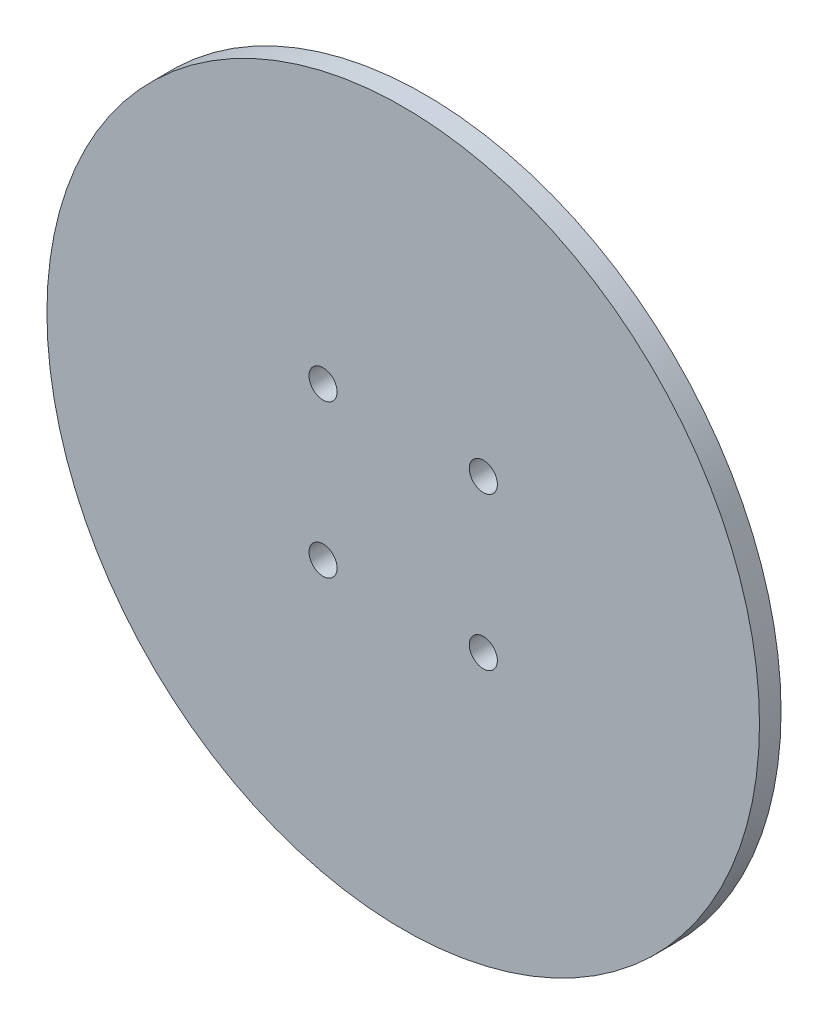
ISO-10303-21;
HEADER;
FILE_DESCRIPTION(('STEP AP214'),'2;1');
FILE_NAME('part.step','',(''),(''),'','','');
FILE_SCHEMA(('AUTOMOTIVE_DESIGN { 1 0 10303 214 1 1 1 1 }'));
ENDSEC;
DATA;
#1=APPLICATION_CONTEXT('core data for automotive mechanical design processes');
#2=APPLICATION_PROTOCOL_DEFINITION('international standard','automotive_design',2000,#1);
#3=PRODUCT_CONTEXT('',#1,'mechanical');
#4=PRODUCT('Part','Part','',(#3));
#5=PRODUCT_RELATED_PRODUCT_CATEGORY('part','',(#4));
#6=PRODUCT_DEFINITION_FORMATION('','',#4);
#7=PRODUCT_DEFINITION_CONTEXT('part definition',#1,'design');
#8=PRODUCT_DEFINITION('design','',#6,#7);
#9=PRODUCT_DEFINITION_SHAPE('','',#8);
#10=(LENGTH_UNIT() NAMED_UNIT(*) SI_UNIT(.MILLI.,.METRE.));
#11=(NAMED_UNIT(*) PLANE_ANGLE_UNIT() SI_UNIT($,.RADIAN.));
#12=(NAMED_UNIT(*) SI_UNIT($,.STERADIAN.) SOLID_ANGLE_UNIT());
#13=UNCERTAINTY_MEASURE_WITH_UNIT(LENGTH_MEASURE(1.E-05),#10,'distance_accuracy_value','');
#14=(GEOMETRIC_REPRESENTATION_CONTEXT(3) GLOBAL_UNCERTAINTY_ASSIGNED_CONTEXT((#13)) GLOBAL_UNIT_ASSIGNED_CONTEXT((#10,
#11,#12)) REPRESENTATION_CONTEXT('',''));
#15=CARTESIAN_POINT('',(0.,0.,0.));
#16=DIRECTION('',(0.,0.,1.));
#17=DIRECTION('',(1.,0.,0.));
#18=AXIS2_PLACEMENT_3D('',#15,#16,#17);
#19=CARTESIAN_POINT('',(0.,0.,4.));
#20=DIRECTION('',(0.,0.,-1.));
#21=DIRECTION('',(-1.,0.,0.));
#22=AXIS2_PLACEMENT_3D('',#19,#20,#21);
#23=CYLINDRICAL_SURFACE('',#22,66.);
#24=CARTESIAN_POINT('',(0.,0.,4.));
#25=DIRECTION('',(0.,0.,1.));
#26=DIRECTION('',(1.,0.,0.));
#27=AXIS2_PLACEMENT_3D('',#24,#25,#26);
#28=CIRCLE('',#27,66.);
#29=CARTESIAN_POINT('',(66.,0.,4.));
#30=VERTEX_POINT('',#29);
#31=EDGE_CURVE('E10',#30,#30,#28,.T.);
#32=ORIENTED_EDGE('',*,*,#31,.F.);
#33=EDGE_LOOP('',(#32));
#34=FACE_BOUND('',#33,.T.);
#35=CARTESIAN_POINT('',(0.,0.,0.));
#36=DIRECTION('',(0.,0.,1.));
#37=DIRECTION('',(1.,0.,0.));
#38=AXIS2_PLACEMENT_3D('',#35,#36,#37);
#39=CIRCLE('',#38,66.);
#40=CARTESIAN_POINT('',(66.,0.,0.));
#41=VERTEX_POINT('',#40);
#42=EDGE_CURVE('E46',#41,#41,#39,.T.);
#43=ORIENTED_EDGE('',*,*,#42,.T.);
#44=EDGE_LOOP('',(#43));
#45=FACE_BOUND('',#44,.T.);
#46=ADVANCED_FACE('F43',(#34,#45),#23,.T.);
#47=CARTESIAN_POINT('',(0.,0.,4.));
#48=DIRECTION('',(0.,0.,1.));
#49=DIRECTION('',(1.,0.,0.));
#50=AXIS2_PLACEMENT_3D('',#47,#48,#49);
#51=PLANE('',#50);
#52=CARTESIAN_POINT('',(14.845865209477,-14.136841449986,4.));
#53=DIRECTION('',(0.,0.,-1.));
#54=DIRECTION('',(-1.,0.,0.));
#55=AXIS2_PLACEMENT_3D('',#52,#53,#54);
#56=CIRCLE('',#55,2.6);
#57=CARTESIAN_POINT('',(12.245865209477,-14.136841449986,4.));
#58=VERTEX_POINT('',#57);
#59=EDGE_CURVE('E62',#58,#58,#56,.T.);
#60=ORIENTED_EDGE('',*,*,#59,.T.);
#61=EDGE_LOOP('',(#60));
#62=FACE_BOUND('',#61,.T.);
#63=CARTESIAN_POINT('',(-14.845865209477,-14.136841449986,4.));
#64=DIRECTION('',(0.,0.,-1.));
#65=DIRECTION('',(-1.,0.,0.));
#66=AXIS2_PLACEMENT_3D('',#63,#64,#65);
#67=CIRCLE('',#66,2.6);
#68=CARTESIAN_POINT('',(-17.445865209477,-14.136841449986,4.));
#69=VERTEX_POINT('',#68);
#70=EDGE_CURVE('E72',#69,#69,#67,.T.);
#71=ORIENTED_EDGE('',*,*,#70,.T.);
#72=EDGE_LOOP('',(#71));
#73=FACE_BOUND('',#72,.T.);
#74=CARTESIAN_POINT('',(-14.845865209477,14.136841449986,4.));
#75=DIRECTION('',(0.,0.,-1.));
#76=DIRECTION('',(-1.,0.,0.));
#77=AXIS2_PLACEMENT_3D('',#74,#75,#76);
#78=CIRCLE('',#77,2.6);
#79=CARTESIAN_POINT('',(-17.445865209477,14.136841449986,4.));
#80=VERTEX_POINT('',#79);
#81=EDGE_CURVE('E83',#80,#80,#78,.T.);
#82=ORIENTED_EDGE('',*,*,#81,.T.);
#83=EDGE_LOOP('',(#82));
#84=FACE_BOUND('',#83,.T.);
#85=CARTESIAN_POINT('',(14.845865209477,14.136841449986,4.));
#86=DIRECTION('',(0.,0.,-1.));
#87=DIRECTION('',(-1.,0.,0.));
#88=AXIS2_PLACEMENT_3D('',#85,#86,#87);
#89=CIRCLE('',#88,2.60000000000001);
#90=CARTESIAN_POINT('',(12.245865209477,14.136841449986,4.));
#91=VERTEX_POINT('',#90);
#92=EDGE_CURVE('E54',#91,#91,#89,.T.);
#93=ORIENTED_EDGE('',*,*,#92,.T.);
#94=EDGE_LOOP('',(#93));
#95=FACE_BOUND('',#94,.T.);
#96=ORIENTED_EDGE('',*,*,#31,.T.);
#97=EDGE_LOOP('',(#96));
#98=FACE_BOUND('',#97,.T.);
#99=ADVANCED_FACE('F94',(#62,#73,#84,#95,#98),#51,.T.);
#100=CARTESIAN_POINT('',(0.,0.,0.));
#101=DIRECTION('',(0.,0.,1.));
#102=DIRECTION('',(1.,0.,0.));
#103=AXIS2_PLACEMENT_3D('',#100,#101,#102);
#104=PLANE('',#103);
#105=CARTESIAN_POINT('',(14.845865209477,-14.136841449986,0.));
#106=DIRECTION('',(0.,0.,-1.));
#107=DIRECTION('',(-1.,0.,0.));
#108=AXIS2_PLACEMENT_3D('',#105,#106,#107);
#109=CIRCLE('',#108,2.6);
#110=CARTESIAN_POINT('',(12.245865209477,-14.136841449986,0.));
#111=VERTEX_POINT('',#110);
#112=EDGE_CURVE('E68',#111,#111,#109,.T.);
#113=ORIENTED_EDGE('',*,*,#112,.F.);
#114=EDGE_LOOP('',(#113));
#115=FACE_BOUND('',#114,.T.);
#116=CARTESIAN_POINT('',(-14.845865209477,-14.136841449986,0.));
#117=DIRECTION('',(0.,0.,-1.));
#118=DIRECTION('',(-1.,0.,0.));
#119=AXIS2_PLACEMENT_3D('',#116,#117,#118);
#120=CIRCLE('',#119,2.6);
#121=CARTESIAN_POINT('',(-17.445865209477,-14.136841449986,0.));
#122=VERTEX_POINT('',#121);
#123=EDGE_CURVE('E80',#122,#122,#120,.T.);
#124=ORIENTED_EDGE('',*,*,#123,.F.);
#125=EDGE_LOOP('',(#124));
#126=FACE_BOUND('',#125,.T.);
#127=CARTESIAN_POINT('',(-14.845865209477,14.136841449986,0.));
#128=DIRECTION('',(0.,0.,-1.));
#129=DIRECTION('',(-1.,0.,0.));
#130=AXIS2_PLACEMENT_3D('',#127,#128,#129);
#131=CIRCLE('',#130,2.6);
#132=CARTESIAN_POINT('',(-17.445865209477,14.136841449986,0.));
#133=VERTEX_POINT('',#132);
#134=EDGE_CURVE('E63',#133,#133,#131,.T.);
#135=ORIENTED_EDGE('',*,*,#134,.F.);
#136=EDGE_LOOP('',(#135));
#137=FACE_BOUND('',#136,.T.);
#138=CARTESIAN_POINT('',(14.845865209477,14.136841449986,0.));
#139=DIRECTION('',(0.,0.,-1.));
#140=DIRECTION('',(-1.,0.,0.));
#141=AXIS2_PLACEMENT_3D('',#138,#139,#140);
#142=CIRCLE('',#141,2.60000000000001);
#143=CARTESIAN_POINT('',(12.245865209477,14.136841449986,0.));
#144=VERTEX_POINT('',#143);
#145=EDGE_CURVE('E60',#144,#144,#142,.T.);
#146=ORIENTED_EDGE('',*,*,#145,.F.);
#147=EDGE_LOOP('',(#146));
#148=FACE_BOUND('',#147,.T.);
#149=ORIENTED_EDGE('',*,*,#42,.F.);
#150=EDGE_LOOP('',(#149));
#151=FACE_BOUND('',#150,.T.);
#152=ADVANCED_FACE('F91',(#115,#126,#137,#148,#151),#104,.F.);
#153=CARTESIAN_POINT('',(14.845865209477,14.136841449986,4.));
#154=DIRECTION('',(0.,0.,-1.));
#155=DIRECTION('',(-1.,0.,0.));
#156=AXIS2_PLACEMENT_3D('',#153,#154,#155);
#157=CYLINDRICAL_SURFACE('',#156,2.60000000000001);
#158=ORIENTED_EDGE('',*,*,#92,.F.);
#159=EDGE_LOOP('',(#158));
#160=FACE_BOUND('',#159,.T.);
#161=ORIENTED_EDGE('',*,*,#145,.T.);
#162=EDGE_LOOP('',(#161));
#163=FACE_BOUND('',#162,.T.);
#164=ADVANCED_FACE('F93',(#160,#163),#157,.F.);
#165=CARTESIAN_POINT('',(-14.845865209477,14.136841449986,4.));
#166=DIRECTION('',(0.,0.,-1.));
#167=DIRECTION('',(-1.,0.,0.));
#168=AXIS2_PLACEMENT_3D('',#165,#166,#167);
#169=CYLINDRICAL_SURFACE('',#168,2.6);
#170=ORIENTED_EDGE('',*,*,#81,.F.);
#171=EDGE_LOOP('',(#170));
#172=FACE_BOUND('',#171,.T.);
#173=ORIENTED_EDGE('',*,*,#134,.T.);
#174=EDGE_LOOP('',(#173));
#175=FACE_BOUND('',#174,.T.);
#176=ADVANCED_FACE('F88',(#172,#175),#169,.F.);
#177=CARTESIAN_POINT('',(-14.845865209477,-14.136841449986,4.));
#178=DIRECTION('',(0.,0.,-1.));
#179=DIRECTION('',(-1.,0.,0.));
#180=AXIS2_PLACEMENT_3D('',#177,#178,#179);
#181=CYLINDRICAL_SURFACE('',#180,2.6);
#182=ORIENTED_EDGE('',*,*,#70,.F.);
#183=EDGE_LOOP('',(#182));
#184=FACE_BOUND('',#183,.T.);
#185=ORIENTED_EDGE('',*,*,#123,.T.);
#186=EDGE_LOOP('',(#185));
#187=FACE_BOUND('',#186,.T.);
#188=ADVANCED_FACE('F117',(#184,#187),#181,.F.);
#189=CARTESIAN_POINT('',(14.845865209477,-14.136841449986,4.));
#190=DIRECTION('',(0.,0.,-1.));
#191=DIRECTION('',(-1.,0.,0.));
#192=AXIS2_PLACEMENT_3D('',#189,#190,#191);
#193=CYLINDRICAL_SURFACE('',#192,2.6);
#194=ORIENTED_EDGE('',*,*,#59,.F.);
#195=EDGE_LOOP('',(#194));
#196=FACE_BOUND('',#195,.T.);
#197=ORIENTED_EDGE('',*,*,#112,.T.);
#198=EDGE_LOOP('',(#197));
#199=FACE_BOUND('',#198,.T.);
#200=ADVANCED_FACE('F114',(#196,#199),#193,.F.);
#201=CLOSED_SHELL('',(#46,#99,#152,#164,#176,#188,#200));
#202=MANIFOLD_SOLID_BREP('B2',#201);
#203=ADVANCED_BREP_SHAPE_REPRESENTATION('',(#18,#202),#14);
#204=SHAPE_DEFINITION_REPRESENTATION(#9,#203);
ENDSEC;
END-ISO-10303-21;
